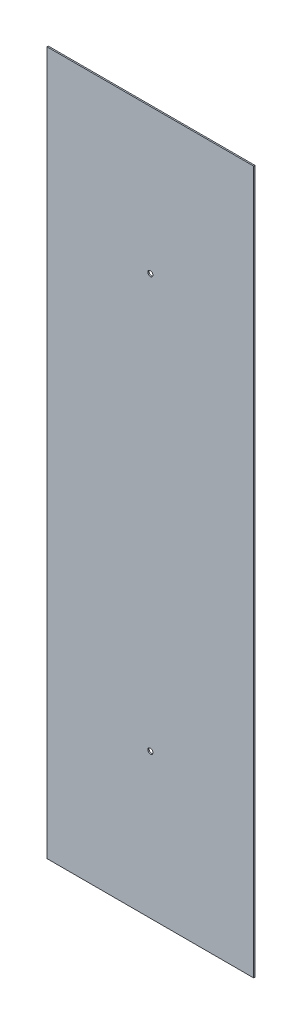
from build123d import *

# Parameters (mm, degrees)
SKETCH1_W           = 500
SKETCH1_H           = 1700
SKETCH1_R           = 6.280230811
BOSS_EXTRUDE1_DEPTH = 3.175


with BuildPart() as part:
    # Sketch1 → Boss-Extrude1 (new body)
    with BuildSketch(Plane.XY):
        Rectangle(SKETCH1_W, SKETCH1_H)
        with Locations((0, 500)):
            Circle(SKETCH1_R, mode=Mode.SUBTRACT)
        with Locations((0, -500)):
            Circle(SKETCH1_R, mode=Mode.SUBTRACT)
    extrude(amount=BOSS_EXTRUDE1_DEPTH)


solid = part.part
